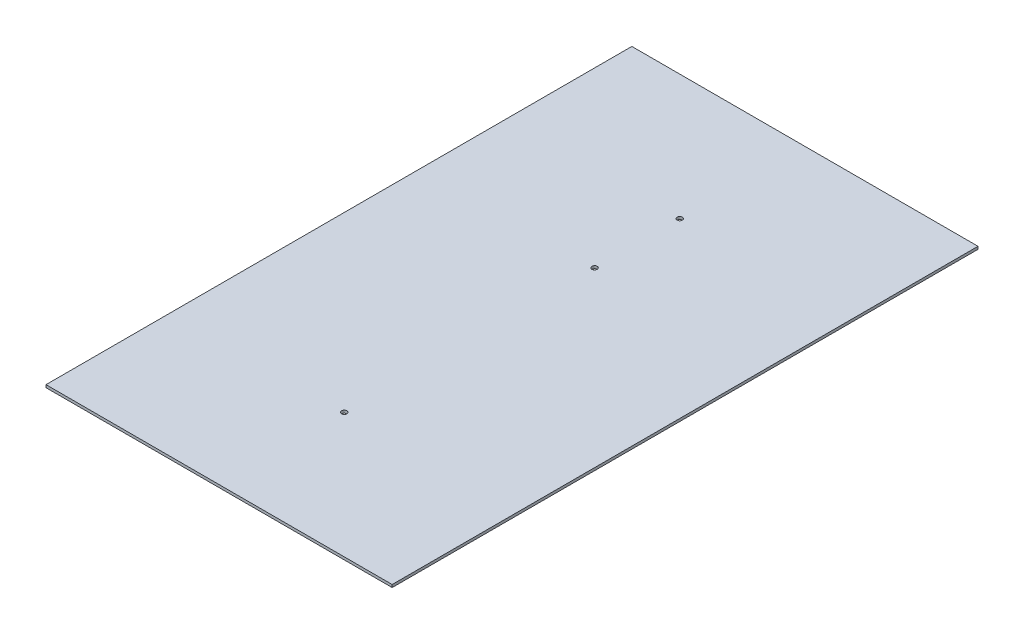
from build123d import *

# Parameters (mm, degrees)
SKETCH_1_W      = 130
SKETCH_1_H      = 220
SKETCH_1_R      = 1
EXTRUDE_1_DEPTH = 1


with BuildPart() as part:
    # Sketch 1 → Extrude 1 (new body)
    with BuildSketch(Plane(origin=(0, 0, 0), x_dir=(1, 0, 0), z_dir=(0, 1, 0))):
        Rectangle(SKETCH_1_W, SKETCH_1_H)
        with Locations(Location((0, 63, 0), (0, 0, 270))):
            Circle(SKETCH_1_R, mode=Mode.SUBTRACT)
        with Locations(Location((0, 31, 0), (0, 0, 270))):
            Circle(SKETCH_1_R, mode=Mode.SUBTRACT)
        with Locations(Location((0, -63, 0), (0, 0, 270))):
            Circle(SKETCH_1_R, mode=Mode.SUBTRACT)
    extrude(amount=EXTRUDE_1_DEPTH)


solid = part.part
